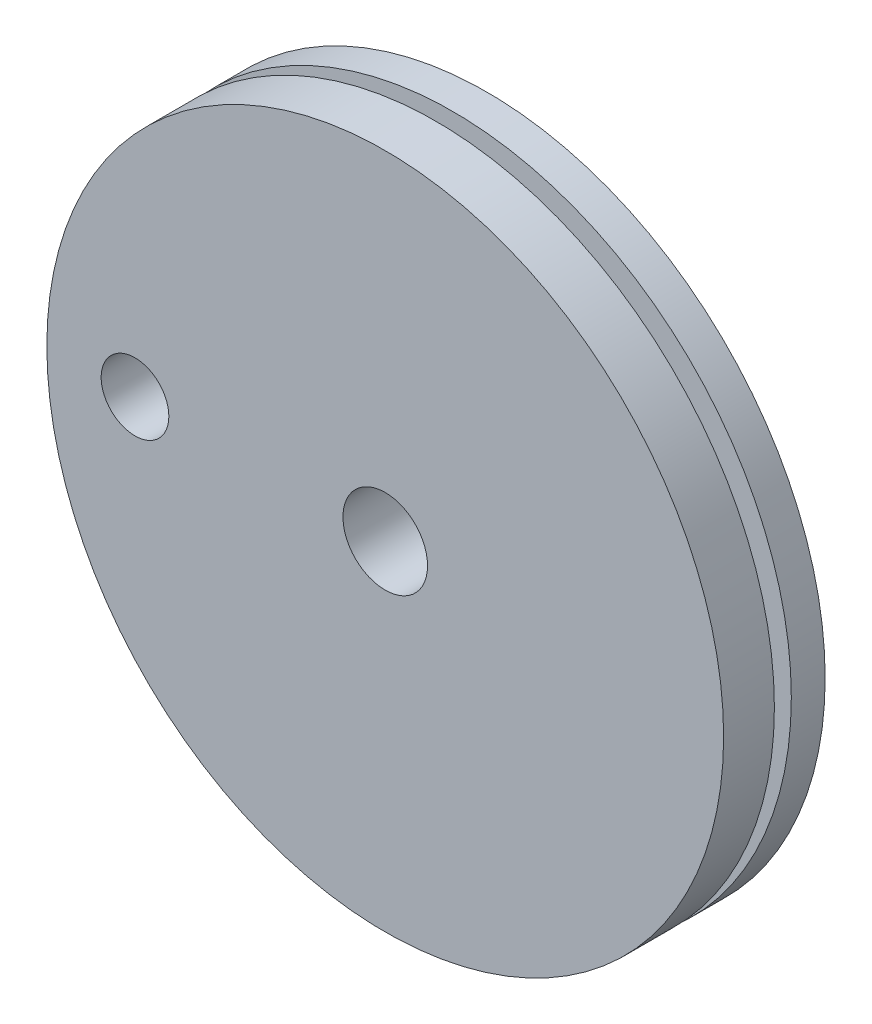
ISO-10303-21;
HEADER;
FILE_DESCRIPTION(('STEP AP214'),'2;1');
FILE_NAME('part.step','',(''),(''),'','','');
FILE_SCHEMA(('AUTOMOTIVE_DESIGN { 1 0 10303 214 1 1 1 1 }'));
ENDSEC;
DATA;
#1=APPLICATION_CONTEXT('core data for automotive mechanical design processes');
#2=APPLICATION_PROTOCOL_DEFINITION('international standard','automotive_design',2000,#1);
#3=PRODUCT_CONTEXT('',#1,'mechanical');
#4=PRODUCT('Part','Part','',(#3));
#5=PRODUCT_RELATED_PRODUCT_CATEGORY('part','',(#4));
#6=PRODUCT_DEFINITION_FORMATION('','',#4);
#7=PRODUCT_DEFINITION_CONTEXT('part definition',#1,'design');
#8=PRODUCT_DEFINITION('design','',#6,#7);
#9=PRODUCT_DEFINITION_SHAPE('','',#8);
#10=(LENGTH_UNIT() NAMED_UNIT(*) SI_UNIT(.MILLI.,.METRE.));
#11=(NAMED_UNIT(*) PLANE_ANGLE_UNIT() SI_UNIT($,.RADIAN.));
#12=(NAMED_UNIT(*) SI_UNIT($,.STERADIAN.) SOLID_ANGLE_UNIT());
#13=UNCERTAINTY_MEASURE_WITH_UNIT(LENGTH_MEASURE(1.E-05),#10,'distance_accuracy_value','');
#14=(GEOMETRIC_REPRESENTATION_CONTEXT(3) GLOBAL_UNCERTAINTY_ASSIGNED_CONTEXT((#13)) GLOBAL_UNIT_ASSIGNED_CONTEXT((#10,
#11,#12)) REPRESENTATION_CONTEXT('',''));
#15=CARTESIAN_POINT('',(0.,0.,0.));
#16=DIRECTION('',(0.,0.,1.));
#17=DIRECTION('',(1.,0.,0.));
#18=AXIS2_PLACEMENT_3D('',#15,#16,#17);
#19=CARTESIAN_POINT('',(0.,0.,3.));
#20=DIRECTION('',(0.,0.,-1.));
#21=DIRECTION('',(-1.,0.,0.));
#22=AXIS2_PLACEMENT_3D('',#19,#20,#21);
#23=CYLINDRICAL_SURFACE('',#22,20.);
#24=CARTESIAN_POINT('',(0.,0.,0.));
#25=DIRECTION('',(0.,0.,1.));
#26=DIRECTION('',(1.,0.,0.));
#27=AXIS2_PLACEMENT_3D('',#24,#25,#26);
#28=CIRCLE('',#27,20.);
#29=CARTESIAN_POINT('',(20.,0.,0.));
#30=VERTEX_POINT('',#29);
#31=EDGE_CURVE('E11',#30,#30,#28,.T.);
#32=ORIENTED_EDGE('',*,*,#31,.T.);
#33=EDGE_LOOP('',(#32));
#34=FACE_BOUND('',#33,.T.);
#35=CARTESIAN_POINT('',(0.,0.,2.));
#36=DIRECTION('',(0.,0.,1.));
#37=DIRECTION('',(1.,0.,0.));
#38=AXIS2_PLACEMENT_3D('',#35,#36,#37);
#39=CIRCLE('',#38,20.);
#40=CARTESIAN_POINT('',(20.,0.,2.));
#41=VERTEX_POINT('',#40);
#42=EDGE_CURVE('E33',#41,#41,#39,.T.);
#43=ORIENTED_EDGE('',*,*,#42,.F.);
#44=EDGE_LOOP('',(#43));
#45=FACE_BOUND('',#44,.T.);
#46=ADVANCED_FACE('F30',(#34,#45),#23,.T.);
#47=CARTESIAN_POINT('',(0.,0.,0.));
#48=DIRECTION('',(0.,0.,1.));
#49=DIRECTION('',(1.,0.,0.));
#50=AXIS2_PLACEMENT_3D('',#47,#48,#49);
#51=PLANE('',#50);
#52=CARTESIAN_POINT('',(-14.7887987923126,0.,0.));
#53=DIRECTION('',(0.,0.,1.));
#54=DIRECTION('',(1.,0.,0.));
#55=AXIS2_PLACEMENT_3D('',#52,#53,#54);
#56=CIRCLE('',#55,2.);
#57=CARTESIAN_POINT('',(-12.7887987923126,0.,0.));
#58=VERTEX_POINT('',#57);
#59=EDGE_CURVE('E59',#58,#58,#56,.T.);
#60=ORIENTED_EDGE('',*,*,#59,.T.);
#61=EDGE_LOOP('',(#60));
#62=FACE_BOUND('',#61,.T.);
#63=CARTESIAN_POINT('',(0.,0.,0.));
#64=DIRECTION('',(0.,0.,1.));
#65=DIRECTION('',(1.,0.,0.));
#66=AXIS2_PLACEMENT_3D('',#63,#64,#65);
#67=CIRCLE('',#66,2.5);
#68=CARTESIAN_POINT('',(2.5,0.,0.));
#69=VERTEX_POINT('',#68);
#70=EDGE_CURVE('E53',#69,#69,#67,.T.);
#71=ORIENTED_EDGE('',*,*,#70,.T.);
#72=EDGE_LOOP('',(#71));
#73=FACE_BOUND('',#72,.T.);
#74=ORIENTED_EDGE('',*,*,#31,.F.);
#75=EDGE_LOOP('',(#74));
#76=FACE_BOUND('',#75,.T.);
#77=ADVANCED_FACE('F95',(#62,#73,#76),#51,.F.);
#78=CARTESIAN_POINT('',(0.,0.,2.));
#79=DIRECTION('',(0.,0.,1.));
#80=DIRECTION('',(1.,0.,0.));
#81=AXIS2_PLACEMENT_3D('',#78,#79,#80);
#82=PLANE('',#81);
#83=CARTESIAN_POINT('',(0.,0.,2.));
#84=DIRECTION('',(0.,0.,1.));
#85=DIRECTION('',(1.,0.,0.));
#86=AXIS2_PLACEMENT_3D('',#83,#84,#85);
#87=CIRCLE('',#86,18.5);
#88=CARTESIAN_POINT('',(18.5,0.,2.));
#89=VERTEX_POINT('',#88);
#90=EDGE_CURVE('E40',#89,#89,#87,.T.);
#91=ORIENTED_EDGE('',*,*,#90,.F.);
#92=EDGE_LOOP('',(#91));
#93=FACE_BOUND('',#92,.T.);
#94=ORIENTED_EDGE('',*,*,#42,.T.);
#95=EDGE_LOOP('',(#94));
#96=FACE_BOUND('',#95,.T.);
#97=ADVANCED_FACE('F99',(#93,#96),#82,.T.);
#98=CARTESIAN_POINT('',(0.,0.,2.));
#99=DIRECTION('',(0.,0.,1.));
#100=DIRECTION('',(1.,0.,0.));
#101=AXIS2_PLACEMENT_3D('',#98,#99,#100);
#102=CYLINDRICAL_SURFACE('',#101,18.5);
#103=ORIENTED_EDGE('',*,*,#90,.T.);
#104=EDGE_LOOP('',(#103));
#105=FACE_BOUND('',#104,.T.);
#106=CARTESIAN_POINT('',(0.,0.,3.));
#107=DIRECTION('',(0.,0.,1.));
#108=DIRECTION('',(1.,0.,0.));
#109=AXIS2_PLACEMENT_3D('',#106,#107,#108);
#110=CIRCLE('',#109,18.5);
#111=CARTESIAN_POINT('',(18.5,0.,3.));
#112=VERTEX_POINT('',#111);
#113=EDGE_CURVE('E44',#112,#112,#110,.T.);
#114=ORIENTED_EDGE('',*,*,#113,.F.);
#115=EDGE_LOOP('',(#114));
#116=FACE_BOUND('',#115,.T.);
#117=ADVANCED_FACE('F80',(#105,#116),#102,.T.);
#118=CARTESIAN_POINT('',(0.,0.,6.));
#119=DIRECTION('',(0.,0.,-1.));
#120=DIRECTION('',(-1.,0.,0.));
#121=AXIS2_PLACEMENT_3D('',#118,#119,#120);
#122=CYLINDRICAL_SURFACE('',#121,20.);
#123=CARTESIAN_POINT('',(0.,0.,6.));
#124=DIRECTION('',(0.,0.,1.));
#125=DIRECTION('',(1.,0.,0.));
#126=AXIS2_PLACEMENT_3D('',#123,#124,#125);
#127=CIRCLE('',#126,20.);
#128=CARTESIAN_POINT('',(20.,0.,6.));
#129=VERTEX_POINT('',#128);
#130=EDGE_CURVE('E47',#129,#129,#127,.T.);
#131=ORIENTED_EDGE('',*,*,#130,.F.);
#132=EDGE_LOOP('',(#131));
#133=FACE_BOUND('',#132,.T.);
#134=CARTESIAN_POINT('',(0.,0.,3.));
#135=DIRECTION('',(0.,0.,1.));
#136=DIRECTION('',(1.,0.,0.));
#137=AXIS2_PLACEMENT_3D('',#134,#135,#136);
#138=CIRCLE('',#137,20.);
#139=CARTESIAN_POINT('',(20.,0.,3.));
#140=VERTEX_POINT('',#139);
#141=EDGE_CURVE('E50',#140,#140,#138,.T.);
#142=ORIENTED_EDGE('',*,*,#141,.T.);
#143=EDGE_LOOP('',(#142));
#144=FACE_BOUND('',#143,.T.);
#145=ADVANCED_FACE('F72',(#133,#144),#122,.T.);
#146=CARTESIAN_POINT('',(0.,0.,6.));
#147=DIRECTION('',(0.,0.,1.));
#148=DIRECTION('',(1.,0.,0.));
#149=AXIS2_PLACEMENT_3D('',#146,#147,#148);
#150=PLANE('',#149);
#151=CARTESIAN_POINT('',(-14.7887987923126,0.,6.));
#152=DIRECTION('',(0.,0.,1.));
#153=DIRECTION('',(1.,0.,0.));
#154=AXIS2_PLACEMENT_3D('',#151,#152,#153);
#155=CIRCLE('',#154,2.);
#156=CARTESIAN_POINT('',(-12.7887987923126,0.,6.));
#157=VERTEX_POINT('',#156);
#158=EDGE_CURVE('E62',#157,#157,#155,.T.);
#159=ORIENTED_EDGE('',*,*,#158,.F.);
#160=EDGE_LOOP('',(#159));
#161=FACE_BOUND('',#160,.T.);
#162=CARTESIAN_POINT('',(0.,0.,6.));
#163=DIRECTION('',(0.,0.,1.));
#164=DIRECTION('',(1.,0.,0.));
#165=AXIS2_PLACEMENT_3D('',#162,#163,#164);
#166=CIRCLE('',#165,2.5);
#167=CARTESIAN_POINT('',(2.5,0.,6.));
#168=VERTEX_POINT('',#167);
#169=EDGE_CURVE('E56',#168,#168,#166,.T.);
#170=ORIENTED_EDGE('',*,*,#169,.F.);
#171=EDGE_LOOP('',(#170));
#172=FACE_BOUND('',#171,.T.);
#173=ORIENTED_EDGE('',*,*,#130,.T.);
#174=EDGE_LOOP('',(#173));
#175=FACE_BOUND('',#174,.T.);
#176=ADVANCED_FACE('F68',(#161,#172,#175),#150,.T.);
#177=CARTESIAN_POINT('',(0.,0.,3.));
#178=DIRECTION('',(0.,0.,1.));
#179=DIRECTION('',(1.,0.,0.));
#180=AXIS2_PLACEMENT_3D('',#177,#178,#179);
#181=PLANE('',#180);
#182=ORIENTED_EDGE('',*,*,#113,.T.);
#183=EDGE_LOOP('',(#182));
#184=FACE_BOUND('',#183,.T.);
#185=ORIENTED_EDGE('',*,*,#141,.F.);
#186=EDGE_LOOP('',(#185));
#187=FACE_BOUND('',#186,.T.);
#188=ADVANCED_FACE('F71',(#184,#187),#181,.F.);
#189=CARTESIAN_POINT('',(0.,0.,0.));
#190=DIRECTION('',(0.,0.,1.));
#191=DIRECTION('',(1.,0.,0.));
#192=AXIS2_PLACEMENT_3D('',#189,#190,#191);
#193=CYLINDRICAL_SURFACE('',#192,2.5);
#194=ORIENTED_EDGE('',*,*,#70,.F.);
#195=EDGE_LOOP('',(#194));
#196=FACE_BOUND('',#195,.T.);
#197=ORIENTED_EDGE('',*,*,#169,.T.);
#198=EDGE_LOOP('',(#197));
#199=FACE_BOUND('',#198,.T.);
#200=ADVANCED_FACE('F85',(#196,#199),#193,.F.);
#201=CARTESIAN_POINT('',(-14.7887987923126,0.,0.));
#202=DIRECTION('',(0.,0.,1.));
#203=DIRECTION('',(1.,0.,0.));
#204=AXIS2_PLACEMENT_3D('',#201,#202,#203);
#205=CYLINDRICAL_SURFACE('',#204,2.);
#206=ORIENTED_EDGE('',*,*,#59,.F.);
#207=EDGE_LOOP('',(#206));
#208=FACE_BOUND('',#207,.T.);
#209=ORIENTED_EDGE('',*,*,#158,.T.);
#210=EDGE_LOOP('',(#209));
#211=FACE_BOUND('',#210,.T.);
#212=ADVANCED_FACE('F66',(#208,#211),#205,.F.);
#213=CLOSED_SHELL('',(#46,#77,#97,#117,#145,#176,#188,#200,#212));
#214=MANIFOLD_SOLID_BREP('B2',#213);
#215=ADVANCED_BREP_SHAPE_REPRESENTATION('',(#18,#214),#14);
#216=SHAPE_DEFINITION_REPRESENTATION(#9,#215);
ENDSEC;
END-ISO-10303-21;
